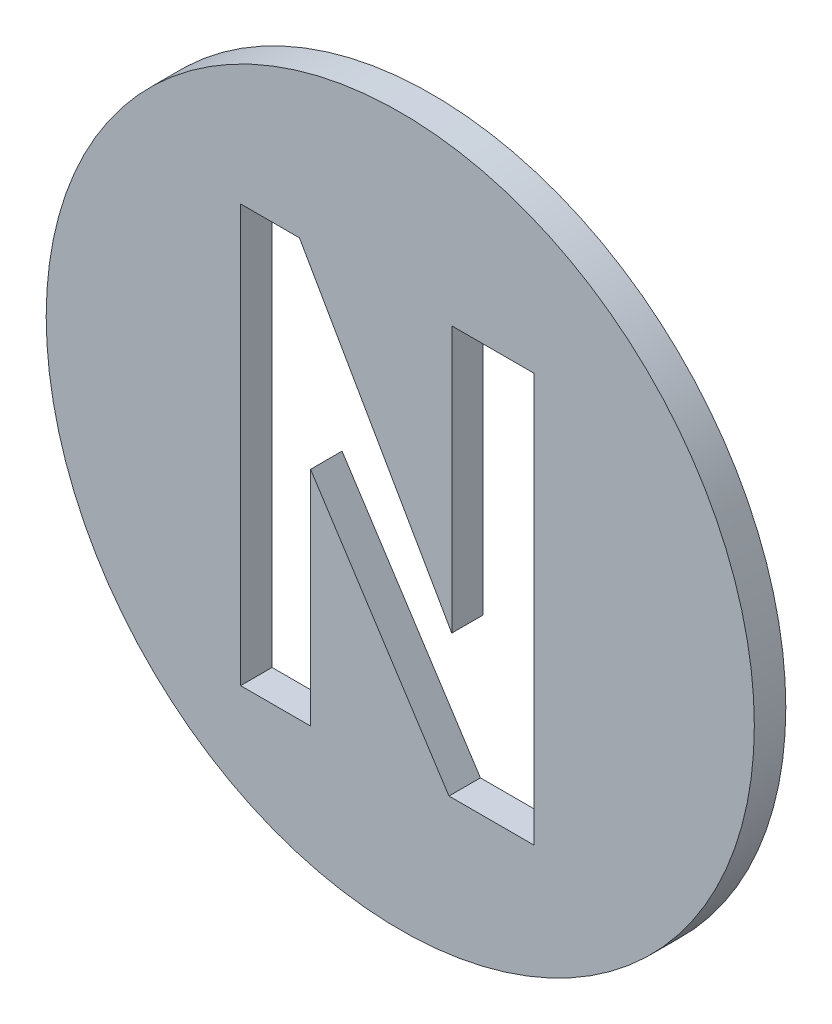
ISO-10303-21;
HEADER;
FILE_DESCRIPTION(('STEP AP214'),'2;1');
FILE_NAME('part.step','',(''),(''),'','','');
FILE_SCHEMA(('AUTOMOTIVE_DESIGN { 1 0 10303 214 1 1 1 1 }'));
ENDSEC;
DATA;
#1=APPLICATION_CONTEXT('core data for automotive mechanical design processes');
#2=APPLICATION_PROTOCOL_DEFINITION('international standard','automotive_design',2000,#1);
#3=PRODUCT_CONTEXT('',#1,'mechanical');
#4=PRODUCT('Part','Part','',(#3));
#5=PRODUCT_RELATED_PRODUCT_CATEGORY('part','',(#4));
#6=PRODUCT_DEFINITION_FORMATION('','',#4);
#7=PRODUCT_DEFINITION_CONTEXT('part definition',#1,'design');
#8=PRODUCT_DEFINITION('design','',#6,#7);
#9=PRODUCT_DEFINITION_SHAPE('','',#8);
#10=(LENGTH_UNIT() NAMED_UNIT(*) SI_UNIT(.MILLI.,.METRE.));
#11=(NAMED_UNIT(*) PLANE_ANGLE_UNIT() SI_UNIT($,.RADIAN.));
#12=(NAMED_UNIT(*) SI_UNIT($,.STERADIAN.) SOLID_ANGLE_UNIT());
#13=UNCERTAINTY_MEASURE_WITH_UNIT(LENGTH_MEASURE(1.E-05),#10,'distance_accuracy_value','');
#14=(GEOMETRIC_REPRESENTATION_CONTEXT(3) GLOBAL_UNCERTAINTY_ASSIGNED_CONTEXT((#13)) GLOBAL_UNIT_ASSIGNED_CONTEXT((#10,
#11,#12)) REPRESENTATION_CONTEXT('',''));
#15=CARTESIAN_POINT('',(0.,0.,0.));
#16=DIRECTION('',(0.,0.,1.));
#17=DIRECTION('',(1.,0.,0.));
#18=AXIS2_PLACEMENT_3D('',#15,#16,#17);
#19=CARTESIAN_POINT('',(0.,0.,4.));
#20=DIRECTION('',(0.,0.,-1.));
#21=DIRECTION('',(-1.,0.,0.));
#22=AXIS2_PLACEMENT_3D('',#19,#20,#21);
#23=CYLINDRICAL_SURFACE('',#22,45.);
#24=CARTESIAN_POINT('',(0.,0.,4.));
#25=DIRECTION('',(0.,0.,1.));
#26=DIRECTION('',(1.,0.,0.));
#27=AXIS2_PLACEMENT_3D('',#24,#25,#26);
#28=CIRCLE('',#27,45.);
#29=CARTESIAN_POINT('',(45.,0.,4.));
#30=VERTEX_POINT('',#29);
#31=EDGE_CURVE('E11',#30,#30,#28,.T.);
#32=ORIENTED_EDGE('',*,*,#31,.F.);
#33=EDGE_LOOP('',(#32));
#34=FACE_BOUND('',#33,.T.);
#35=CARTESIAN_POINT('',(0.,0.,0.));
#36=DIRECTION('',(0.,0.,1.));
#37=DIRECTION('',(1.,0.,0.));
#38=AXIS2_PLACEMENT_3D('',#35,#36,#37);
#39=CIRCLE('',#38,45.);
#40=CARTESIAN_POINT('',(45.,0.,0.));
#41=VERTEX_POINT('',#40);
#42=EDGE_CURVE('E36',#41,#41,#39,.T.);
#43=ORIENTED_EDGE('',*,*,#42,.T.);
#44=EDGE_LOOP('',(#43));
#45=FACE_BOUND('',#44,.T.);
#46=ADVANCED_FACE('F33',(#34,#45),#23,.T.);
#47=CARTESIAN_POINT('',(0.,0.,4.));
#48=DIRECTION('',(0.,0.,1.));
#49=DIRECTION('',(1.,0.,0.));
#50=AXIS2_PLACEMENT_3D('',#47,#48,#49);
#51=PLANE('',#50);
#52=DIRECTION('',(-0.496726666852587,0.867907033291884,0.));
#53=VECTOR('',#52,1.);
#54=CARTESIAN_POINT('',(-12.8128058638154,24.7671702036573,4.));
#55=LINE('',#54,#53);
#56=CARTESIAN_POINT('',(6.54638860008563,-9.05823550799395,4.));
#57=VERTEX_POINT('',#56);
#58=CARTESIAN_POINT('',(-12.8128058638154,24.7671702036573,4.));
#59=VERTEX_POINT('',#58);
#60=EDGE_CURVE('E47',#57,#59,#55,.T.);
#61=ORIENTED_EDGE('',*,*,#60,.F.);
#62=DIRECTION('',(0.,-1.,0.));
#63=VECTOR('',#62,1.);
#64=CARTESIAN_POINT('',(6.54638860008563,-9.05823550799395,4.));
#65=LINE('',#64,#63);
#66=CARTESIAN_POINT('',(6.54638860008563,24.7671702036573,4.));
#67=VERTEX_POINT('',#66);
#68=EDGE_CURVE('E128',#67,#57,#65,.T.);
#69=ORIENTED_EDGE('',*,*,#68,.F.);
#70=DIRECTION('',(-1.,0.,0.));
#71=VECTOR('',#70,1.);
#72=CARTESIAN_POINT('',(17.0206103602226,24.7671702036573,4.));
#73=LINE('',#72,#71);
#74=CARTESIAN_POINT('',(17.0206103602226,24.7671702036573,4.));
#75=VERTEX_POINT('',#74);
#76=EDGE_CURVE('E131',#75,#67,#73,.T.);
#77=ORIENTED_EDGE('',*,*,#76,.F.);
#78=DIRECTION('',(0.,1.,0.));
#79=VECTOR('',#78,1.);
#80=CARTESIAN_POINT('',(17.0206103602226,-27.1675126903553,4.));
#81=LINE('',#80,#79);
#82=CARTESIAN_POINT('',(17.0206103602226,-27.1675126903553,4.));
#83=VERTEX_POINT('',#82);
#84=EDGE_CURVE('E171',#83,#75,#81,.T.);
#85=ORIENTED_EDGE('',*,*,#84,.F.);
#86=DIRECTION('',(1.,0.,0.));
#87=VECTOR('',#86,1.);
#88=CARTESIAN_POINT('',(6.18844279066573,-27.1675126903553,4.));
#89=LINE('',#88,#87);
#90=CARTESIAN_POINT('',(6.18844279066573,-27.1675126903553,4.));
#91=VERTEX_POINT('',#90);
#92=EDGE_CURVE('E168',#91,#83,#89,.T.);
#93=ORIENTED_EDGE('',*,*,#92,.F.);
#94=DIRECTION('',(0.543440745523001,-0.839447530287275,0.));
#95=VECTOR('',#94,1.);
#96=CARTESIAN_POINT('',(-11.39923579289,0.,4.));
#97=LINE('',#96,#95);
#98=CARTESIAN_POINT('',(-11.39923579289,0.,4.));
#99=VERTEX_POINT('',#98);
#100=EDGE_CURVE('E165',#99,#91,#97,.T.);
#101=ORIENTED_EDGE('',*,*,#100,.F.);
#102=DIRECTION('',(0.,1.,0.));
#103=VECTOR('',#102,1.);
#104=CARTESIAN_POINT('',(-11.39923579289,-28.2585774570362,4.));
#105=LINE('',#104,#103);
#106=CARTESIAN_POINT('',(-11.39923579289,-28.2585774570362,4.));
#107=VERTEX_POINT('',#106);
#108=EDGE_CURVE('E162',#107,#99,#105,.T.);
#109=ORIENTED_EDGE('',*,*,#108,.F.);
#110=DIRECTION('',(1.,0.,0.));
#111=VECTOR('',#110,1.);
#112=CARTESIAN_POINT('',(-20.2938046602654,-28.2585774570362,4.));
#113=LINE('',#112,#111);
#114=CARTESIAN_POINT('',(-20.2938046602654,-28.2585774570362,4.));
#115=VERTEX_POINT('',#114);
#116=EDGE_CURVE('E159',#115,#107,#113,.T.);
#117=ORIENTED_EDGE('',*,*,#116,.F.);
#118=DIRECTION('',(0.,-1.,0.));
#119=VECTOR('',#118,1.);
#120=CARTESIAN_POINT('',(-20.2938046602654,24.7671702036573,4.));
#121=LINE('',#120,#119);
#122=CARTESIAN_POINT('',(-20.2938046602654,24.7671702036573,4.));
#123=VERTEX_POINT('',#122);
#124=EDGE_CURVE('E156',#123,#115,#121,.T.);
#125=ORIENTED_EDGE('',*,*,#124,.F.);
#126=DIRECTION('',(-1.,0.,0.));
#127=VECTOR('',#126,1.);
#128=CARTESIAN_POINT('',(-20.2938046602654,24.7671702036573,4.));
#129=LINE('',#128,#127);
#130=EDGE_CURVE('E154',#59,#123,#129,.T.);
#131=ORIENTED_EDGE('',*,*,#130,.F.);
#132=EDGE_LOOP('',(#61,#69,#77,#85,#93,#101,#109,#117,#125,#131));
#133=FACE_BOUND('',#132,.T.);
#134=ORIENTED_EDGE('',*,*,#31,.T.);
#135=EDGE_LOOP('',(#134));
#136=FACE_BOUND('',#135,.T.);
#137=ADVANCED_FACE('F196',(#133,#136),#51,.T.);
#138=CARTESIAN_POINT('',(0.,0.,0.));
#139=DIRECTION('',(0.,0.,1.));
#140=DIRECTION('',(1.,0.,0.));
#141=AXIS2_PLACEMENT_3D('',#138,#139,#140);
#142=PLANE('',#141);
#143=DIRECTION('',(0.,-1.,0.));
#144=VECTOR('',#143,1.);
#145=CARTESIAN_POINT('',(6.54638860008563,-9.05823550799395,0.));
#146=LINE('',#145,#144);
#147=CARTESIAN_POINT('',(6.54638860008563,24.7671702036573,0.));
#148=VERTEX_POINT('',#147);
#149=CARTESIAN_POINT('',(6.54638860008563,-9.05823550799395,0.));
#150=VERTEX_POINT('',#149);
#151=EDGE_CURVE('E117',#148,#150,#146,.T.);
#152=ORIENTED_EDGE('',*,*,#151,.T.);
#153=DIRECTION('',(-0.496726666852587,0.867907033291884,0.));
#154=VECTOR('',#153,1.);
#155=CARTESIAN_POINT('',(-12.8128058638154,24.7671702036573,0.));
#156=LINE('',#155,#154);
#157=CARTESIAN_POINT('',(-12.8128058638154,24.7671702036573,0.));
#158=VERTEX_POINT('',#157);
#159=EDGE_CURVE('E111',#150,#158,#156,.T.);
#160=ORIENTED_EDGE('',*,*,#159,.T.);
#161=DIRECTION('',(-1.,0.,0.));
#162=VECTOR('',#161,1.);
#163=CARTESIAN_POINT('',(-20.2938046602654,24.7671702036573,0.));
#164=LINE('',#163,#162);
#165=CARTESIAN_POINT('',(-20.2938046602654,24.7671702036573,0.));
#166=VERTEX_POINT('',#165);
#167=EDGE_CURVE('E120',#158,#166,#164,.T.);
#168=ORIENTED_EDGE('',*,*,#167,.T.);
#169=DIRECTION('',(0.,-1.,0.));
#170=VECTOR('',#169,1.);
#171=CARTESIAN_POINT('',(-20.2938046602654,24.7671702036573,0.));
#172=LINE('',#171,#170);
#173=CARTESIAN_POINT('',(-20.2938046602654,-28.2585774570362,0.));
#174=VERTEX_POINT('',#173);
#175=EDGE_CURVE('E55',#166,#174,#172,.T.);
#176=ORIENTED_EDGE('',*,*,#175,.T.);
#177=DIRECTION('',(1.,0.,0.));
#178=VECTOR('',#177,1.);
#179=CARTESIAN_POINT('',(-20.2938046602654,-28.2585774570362,0.));
#180=LINE('',#179,#178);
#181=CARTESIAN_POINT('',(-11.39923579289,-28.2585774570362,0.));
#182=VERTEX_POINT('',#181);
#183=EDGE_CURVE('E135',#174,#182,#180,.T.);
#184=ORIENTED_EDGE('',*,*,#183,.T.);
#185=DIRECTION('',(0.,1.,0.));
#186=VECTOR('',#185,1.);
#187=CARTESIAN_POINT('',(-11.39923579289,-28.2585774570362,0.));
#188=LINE('',#187,#186);
#189=CARTESIAN_POINT('',(-11.39923579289,0.,0.));
#190=VERTEX_POINT('',#189);
#191=EDGE_CURVE('E138',#182,#190,#188,.T.);
#192=ORIENTED_EDGE('',*,*,#191,.T.);
#193=DIRECTION('',(0.543440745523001,-0.839447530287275,0.));
#194=VECTOR('',#193,1.);
#195=CARTESIAN_POINT('',(-11.39923579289,0.,0.));
#196=LINE('',#195,#194);
#197=CARTESIAN_POINT('',(6.18844279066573,-27.1675126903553,0.));
#198=VERTEX_POINT('',#197);
#199=EDGE_CURVE('E141',#190,#198,#196,.T.);
#200=ORIENTED_EDGE('',*,*,#199,.T.);
#201=DIRECTION('',(1.,0.,0.));
#202=VECTOR('',#201,1.);
#203=CARTESIAN_POINT('',(6.18844279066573,-27.1675126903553,0.));
#204=LINE('',#203,#202);
#205=CARTESIAN_POINT('',(17.0206103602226,-27.1675126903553,0.));
#206=VERTEX_POINT('',#205);
#207=EDGE_CURVE('E144',#198,#206,#204,.T.);
#208=ORIENTED_EDGE('',*,*,#207,.T.);
#209=DIRECTION('',(0.,1.,0.));
#210=VECTOR('',#209,1.);
#211=CARTESIAN_POINT('',(17.0206103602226,-27.1675126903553,0.));
#212=LINE('',#211,#210);
#213=CARTESIAN_POINT('',(17.0206103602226,24.7671702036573,0.));
#214=VERTEX_POINT('',#213);
#215=EDGE_CURVE('E147',#206,#214,#212,.T.);
#216=ORIENTED_EDGE('',*,*,#215,.T.);
#217=DIRECTION('',(-1.,0.,0.));
#218=VECTOR('',#217,1.);
#219=CARTESIAN_POINT('',(17.0206103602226,24.7671702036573,0.));
#220=LINE('',#219,#218);
#221=EDGE_CURVE('E150',#214,#148,#220,.T.);
#222=ORIENTED_EDGE('',*,*,#221,.T.);
#223=EDGE_LOOP('',(#152,#160,#168,#176,#184,#192,#200,#208,#216,#222));
#224=FACE_BOUND('',#223,.T.);
#225=ORIENTED_EDGE('',*,*,#42,.F.);
#226=EDGE_LOOP('',(#225));
#227=FACE_BOUND('',#226,.T.);
#228=ADVANCED_FACE('F124',(#224,#227),#142,.F.);
#229=CARTESIAN_POINT('',(-12.8128058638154,24.7671702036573,0.));
#230=DIRECTION('',(0.867907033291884,0.496726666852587,0.));
#231=DIRECTION('',(-0.496726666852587,0.867907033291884,0.));
#232=AXIS2_PLACEMENT_3D('',#229,#230,#231);
#233=PLANE('',#232);
#234=ORIENTED_EDGE('',*,*,#60,.T.);
#235=DIRECTION('',(0.,0.,1.));
#236=VECTOR('',#235,1.);
#237=CARTESIAN_POINT('',(-12.8128058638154,24.7671702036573,0.));
#238=LINE('',#237,#236);
#239=EDGE_CURVE('E107',#158,#59,#238,.T.);
#240=ORIENTED_EDGE('',*,*,#239,.F.);
#241=ORIENTED_EDGE('',*,*,#159,.F.);
#242=DIRECTION('',(0.,0.,1.));
#243=VECTOR('',#242,1.);
#244=CARTESIAN_POINT('',(6.54638860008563,-9.05823550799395,0.));
#245=LINE('',#244,#243);
#246=EDGE_CURVE('E176',#150,#57,#245,.T.);
#247=ORIENTED_EDGE('',*,*,#246,.T.);
#248=EDGE_LOOP('',(#234,#240,#241,#247));
#249=FACE_BOUND('',#248,.T.);
#250=ADVANCED_FACE('F109',(#249),#233,.F.);
#251=CARTESIAN_POINT('',(6.54638860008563,-9.05823550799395,0.));
#252=DIRECTION('',(-1.,0.,0.));
#253=DIRECTION('',(0.,0.,1.));
#254=AXIS2_PLACEMENT_3D('',#251,#252,#253);
#255=PLANE('',#254);
#256=ORIENTED_EDGE('',*,*,#68,.T.);
#257=ORIENTED_EDGE('',*,*,#246,.F.);
#258=ORIENTED_EDGE('',*,*,#151,.F.);
#259=DIRECTION('',(0.,0.,1.));
#260=VECTOR('',#259,1.);
#261=CARTESIAN_POINT('',(6.54638860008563,24.7671702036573,0.));
#262=LINE('',#261,#260);
#263=EDGE_CURVE('E178',#148,#67,#262,.T.);
#264=ORIENTED_EDGE('',*,*,#263,.T.);
#265=EDGE_LOOP('',(#256,#257,#258,#264));
#266=FACE_BOUND('',#265,.T.);
#267=ADVANCED_FACE('F223',(#266),#255,.F.);
#268=CARTESIAN_POINT('',(17.0206103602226,24.7671702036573,0.));
#269=DIRECTION('',(0.,1.,0.));
#270=DIRECTION('',(0.,0.,1.));
#271=AXIS2_PLACEMENT_3D('',#268,#269,#270);
#272=PLANE('',#271);
#273=ORIENTED_EDGE('',*,*,#76,.T.);
#274=ORIENTED_EDGE('',*,*,#263,.F.);
#275=ORIENTED_EDGE('',*,*,#221,.F.);
#276=DIRECTION('',(0.,0.,1.));
#277=VECTOR('',#276,1.);
#278=CARTESIAN_POINT('',(17.0206103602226,24.7671702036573,0.));
#279=LINE('',#278,#277);
#280=EDGE_CURVE('E180',#214,#75,#279,.T.);
#281=ORIENTED_EDGE('',*,*,#280,.T.);
#282=EDGE_LOOP('',(#273,#274,#275,#281));
#283=FACE_BOUND('',#282,.T.);
#284=ADVANCED_FACE('F220',(#283),#272,.F.);
#285=CARTESIAN_POINT('',(17.0206103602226,-27.1675126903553,0.));
#286=DIRECTION('',(1.,0.,0.));
#287=DIRECTION('',(0.,0.,-1.));
#288=AXIS2_PLACEMENT_3D('',#285,#286,#287);
#289=PLANE('',#288);
#290=ORIENTED_EDGE('',*,*,#84,.T.);
#291=ORIENTED_EDGE('',*,*,#280,.F.);
#292=ORIENTED_EDGE('',*,*,#215,.F.);
#293=DIRECTION('',(0.,0.,1.));
#294=VECTOR('',#293,1.);
#295=CARTESIAN_POINT('',(17.0206103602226,-27.1675126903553,0.));
#296=LINE('',#295,#294);
#297=EDGE_CURVE('E182',#206,#83,#296,.T.);
#298=ORIENTED_EDGE('',*,*,#297,.T.);
#299=EDGE_LOOP('',(#290,#291,#292,#298));
#300=FACE_BOUND('',#299,.T.);
#301=ADVANCED_FACE('F216',(#300),#289,.F.);
#302=CARTESIAN_POINT('',(6.18844279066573,-27.1675126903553,0.));
#303=DIRECTION('',(0.,-1.,0.));
#304=DIRECTION('',(0.,0.,-1.));
#305=AXIS2_PLACEMENT_3D('',#302,#303,#304);
#306=PLANE('',#305);
#307=ORIENTED_EDGE('',*,*,#92,.T.);
#308=ORIENTED_EDGE('',*,*,#297,.F.);
#309=ORIENTED_EDGE('',*,*,#207,.F.);
#310=DIRECTION('',(0.,0.,1.));
#311=VECTOR('',#310,1.);
#312=CARTESIAN_POINT('',(6.18844279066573,-27.1675126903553,0.));
#313=LINE('',#312,#311);
#314=EDGE_CURVE('E184',#198,#91,#313,.T.);
#315=ORIENTED_EDGE('',*,*,#314,.T.);
#316=EDGE_LOOP('',(#307,#308,#309,#315));
#317=FACE_BOUND('',#316,.T.);
#318=ADVANCED_FACE('F212',(#317),#306,.F.);
#319=CARTESIAN_POINT('',(-11.39923579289,0.,0.));
#320=DIRECTION('',(-0.839447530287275,-0.543440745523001,0.));
#321=DIRECTION('',(0.543440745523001,-0.839447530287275,0.));
#322=AXIS2_PLACEMENT_3D('',#319,#320,#321);
#323=PLANE('',#322);
#324=ORIENTED_EDGE('',*,*,#100,.T.);
#325=ORIENTED_EDGE('',*,*,#314,.F.);
#326=ORIENTED_EDGE('',*,*,#199,.F.);
#327=DIRECTION('',(0.,0.,1.));
#328=VECTOR('',#327,1.);
#329=CARTESIAN_POINT('',(-11.39923579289,0.,0.));
#330=LINE('',#329,#328);
#331=EDGE_CURVE('E186',#190,#99,#330,.T.);
#332=ORIENTED_EDGE('',*,*,#331,.T.);
#333=EDGE_LOOP('',(#324,#325,#326,#332));
#334=FACE_BOUND('',#333,.T.);
#335=ADVANCED_FACE('F208',(#334),#323,.F.);
#336=CARTESIAN_POINT('',(-11.39923579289,-28.2585774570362,0.));
#337=DIRECTION('',(1.,0.,0.));
#338=DIRECTION('',(0.,0.,-1.));
#339=AXIS2_PLACEMENT_3D('',#336,#337,#338);
#340=PLANE('',#339);
#341=ORIENTED_EDGE('',*,*,#108,.T.);
#342=ORIENTED_EDGE('',*,*,#331,.F.);
#343=ORIENTED_EDGE('',*,*,#191,.F.);
#344=DIRECTION('',(0.,0.,1.));
#345=VECTOR('',#344,1.);
#346=CARTESIAN_POINT('',(-11.39923579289,-28.2585774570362,0.));
#347=LINE('',#346,#345);
#348=EDGE_CURVE('E188',#182,#107,#347,.T.);
#349=ORIENTED_EDGE('',*,*,#348,.T.);
#350=EDGE_LOOP('',(#341,#342,#343,#349));
#351=FACE_BOUND('',#350,.T.);
#352=ADVANCED_FACE('F206',(#351),#340,.F.);
#353=CARTESIAN_POINT('',(-20.2938046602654,-28.2585774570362,0.));
#354=DIRECTION('',(0.,-1.,0.));
#355=DIRECTION('',(0.,0.,-1.));
#356=AXIS2_PLACEMENT_3D('',#353,#354,#355);
#357=PLANE('',#356);
#358=ORIENTED_EDGE('',*,*,#116,.T.);
#359=ORIENTED_EDGE('',*,*,#348,.F.);
#360=ORIENTED_EDGE('',*,*,#183,.F.);
#361=DIRECTION('',(0.,0.,1.));
#362=VECTOR('',#361,1.);
#363=CARTESIAN_POINT('',(-20.2938046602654,-28.2585774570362,0.));
#364=LINE('',#363,#362);
#365=EDGE_CURVE('E190',#174,#115,#364,.T.);
#366=ORIENTED_EDGE('',*,*,#365,.T.);
#367=EDGE_LOOP('',(#358,#359,#360,#366));
#368=FACE_BOUND('',#367,.T.);
#369=ADVANCED_FACE('F201',(#368),#357,.F.);
#370=CARTESIAN_POINT('',(-20.2938046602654,24.7671702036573,0.));
#371=DIRECTION('',(-1.,0.,0.));
#372=DIRECTION('',(0.,-1.,0.));
#373=AXIS2_PLACEMENT_3D('',#370,#371,#372);
#374=PLANE('',#373);
#375=ORIENTED_EDGE('',*,*,#124,.T.);
#376=ORIENTED_EDGE('',*,*,#365,.F.);
#377=ORIENTED_EDGE('',*,*,#175,.F.);
#378=DIRECTION('',(0.,0.,1.));
#379=VECTOR('',#378,1.);
#380=CARTESIAN_POINT('',(-20.2938046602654,24.7671702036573,0.));
#381=LINE('',#380,#379);
#382=EDGE_CURVE('E116',#166,#123,#381,.T.);
#383=ORIENTED_EDGE('',*,*,#382,.T.);
#384=EDGE_LOOP('',(#375,#376,#377,#383));
#385=FACE_BOUND('',#384,.T.);
#386=ADVANCED_FACE('F192',(#385),#374,.F.);
#387=CARTESIAN_POINT('',(-20.2938046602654,24.7671702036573,0.));
#388=DIRECTION('',(0.,1.,0.));
#389=DIRECTION('',(0.,0.,1.));
#390=AXIS2_PLACEMENT_3D('',#387,#388,#389);
#391=PLANE('',#390);
#392=ORIENTED_EDGE('',*,*,#130,.T.);
#393=ORIENTED_EDGE('',*,*,#382,.F.);
#394=ORIENTED_EDGE('',*,*,#167,.F.);
#395=ORIENTED_EDGE('',*,*,#239,.T.);
#396=EDGE_LOOP('',(#392,#393,#394,#395));
#397=FACE_BOUND('',#396,.T.);
#398=ADVANCED_FACE('F121',(#397),#391,.F.);
#399=CLOSED_SHELL('',(#46,#137,#228,#250,#267,#284,#301,#318,#335,#352,#369,#386,#398));
#400=MANIFOLD_SOLID_BREP('B2',#399);
#401=ADVANCED_BREP_SHAPE_REPRESENTATION('',(#18,#400),#14);
#402=SHAPE_DEFINITION_REPRESENTATION(#9,#401);
ENDSEC;
END-ISO-10303-21;
